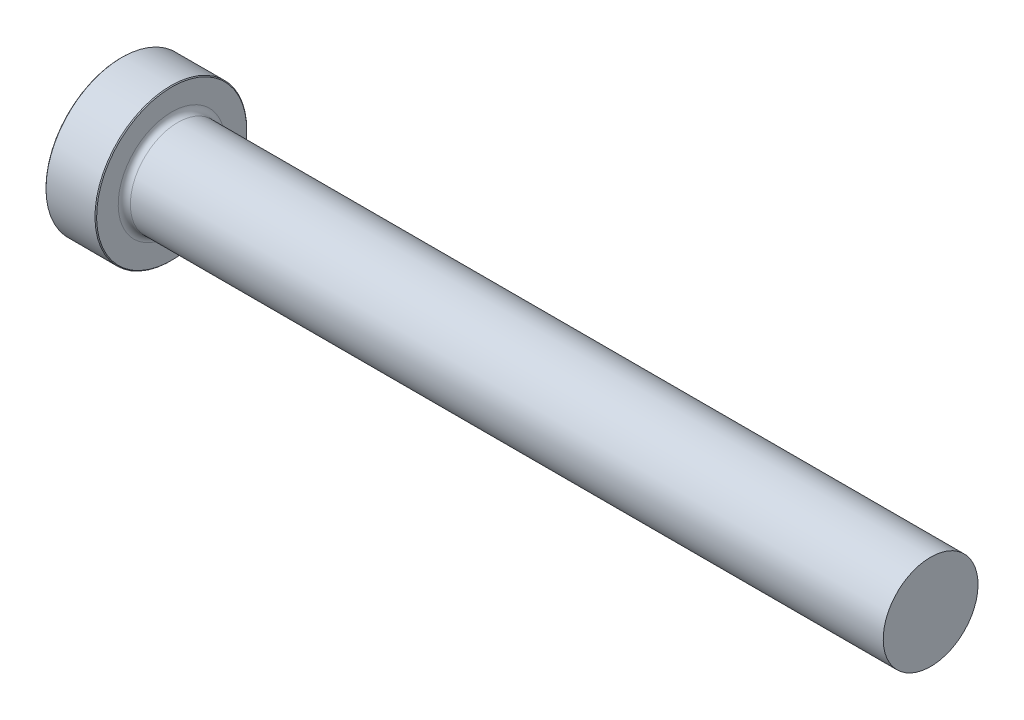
ISO-10303-21;
HEADER;
FILE_DESCRIPTION(('STEP AP214'),'2;1');
FILE_NAME('part.step','',(''),(''),'','','');
FILE_SCHEMA(('AUTOMOTIVE_DESIGN { 1 0 10303 214 1 1 1 1 }'));
ENDSEC;
DATA;
#1=APPLICATION_CONTEXT('core data for automotive mechanical design processes');
#2=APPLICATION_PROTOCOL_DEFINITION('international standard','automotive_design',2000,#1);
#3=PRODUCT_CONTEXT('',#1,'mechanical');
#4=PRODUCT('Part','Part','',(#3));
#5=PRODUCT_RELATED_PRODUCT_CATEGORY('part','',(#4));
#6=PRODUCT_DEFINITION_FORMATION('','',#4);
#7=PRODUCT_DEFINITION_CONTEXT('part definition',#1,'design');
#8=PRODUCT_DEFINITION('design','',#6,#7);
#9=PRODUCT_DEFINITION_SHAPE('','',#8);
#10=(LENGTH_UNIT() NAMED_UNIT(*) SI_UNIT(.MILLI.,.METRE.));
#11=(NAMED_UNIT(*) PLANE_ANGLE_UNIT() SI_UNIT($,.RADIAN.));
#12=(NAMED_UNIT(*) SI_UNIT($,.STERADIAN.) SOLID_ANGLE_UNIT());
#13=UNCERTAINTY_MEASURE_WITH_UNIT(LENGTH_MEASURE(1.E-05),#10,'distance_accuracy_value','');
#14=(GEOMETRIC_REPRESENTATION_CONTEXT(3) GLOBAL_UNCERTAINTY_ASSIGNED_CONTEXT((#13)) GLOBAL_UNIT_ASSIGNED_CONTEXT((#10,
#11,#12)) REPRESENTATION_CONTEXT('',''));
#15=CARTESIAN_POINT('',(0.,0.,0.));
#16=DIRECTION('',(0.,0.,1.));
#17=DIRECTION('',(1.,0.,0.));
#18=AXIS2_PLACEMENT_3D('',#15,#16,#17);
#19=CARTESIAN_POINT('',(101.6,5.94931499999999,0.));
#20=DIRECTION('',(1.,0.,0.));
#21=DIRECTION('',(0.,1.,0.));
#22=AXIS2_PLACEMENT_3D('',#19,#20,#21);
#23=PLANE('',#22);
#24=CARTESIAN_POINT('',(101.6,0.,0.));
#25=DIRECTION('',(1.,0.,0.));
#26=DIRECTION('',(0.,1.,0.));
#27=AXIS2_PLACEMENT_3D('',#24,#25,#26);
#28=CIRCLE('',#27,5.949315);
#29=CARTESIAN_POINT('',(101.6,5.94931499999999,0.));
#30=VERTEX_POINT('',#29);
#31=EDGE_CURVE('E50',#30,#30,#28,.T.);
#32=ORIENTED_EDGE('',*,*,#31,.T.);
#33=EDGE_LOOP('',(#32));
#34=FACE_BOUND('',#33,.T.);
#35=ADVANCED_FACE('F30',(#34),#23,.T.);
#36=CARTESIAN_POINT('',(101.6,0.,0.));
#37=DIRECTION('',(1.,0.,0.));
#38=DIRECTION('',(0.,1.,0.));
#39=AXIS2_PLACEMENT_3D('',#36,#37,#38);
#40=CYLINDRICAL_SURFACE('',#39,5.949315);
#41=CARTESIAN_POINT('',(7.11199999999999,0.,0.));
#42=DIRECTION('',(1.,0.,0.));
#43=DIRECTION('',(0.,1.,0.));
#44=AXIS2_PLACEMENT_3D('',#41,#42,#43);
#45=CIRCLE('',#44,5.94931499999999);
#46=CARTESIAN_POINT('',(7.11199999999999,5.94931499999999,0.));
#47=VERTEX_POINT('',#46);
#48=EDGE_CURVE('E53',#47,#47,#45,.T.);
#49=ORIENTED_EDGE('',*,*,#48,.T.);
#50=EDGE_LOOP('',(#49));
#51=FACE_BOUND('',#50,.T.);
#52=ORIENTED_EDGE('',*,*,#31,.F.);
#53=EDGE_LOOP('',(#52));
#54=FACE_BOUND('',#53,.T.);
#55=ADVANCED_FACE('F74',(#51,#54),#40,.T.);
#56=CARTESIAN_POINT('',(7.112,0.,0.));
#57=DIRECTION('',(1.,0.,0.));
#58=DIRECTION('',(0.,1.,0.));
#59=AXIS2_PLACEMENT_3D('',#56,#57,#58);
#60=TOROIDAL_SURFACE('',#59,6.71131499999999,0.762);
#61=CARTESIAN_POINT('',(6.34999999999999,0.,0.));
#62=DIRECTION('',(1.,0.,0.));
#63=DIRECTION('',(0.,1.,0.));
#64=AXIS2_PLACEMENT_3D('',#61,#62,#63);
#65=CIRCLE('',#64,6.71131499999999);
#66=CARTESIAN_POINT('',(6.34999999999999,6.71131499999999,0.));
#67=VERTEX_POINT('',#66);
#68=EDGE_CURVE('E56',#67,#67,#65,.T.);
#69=ORIENTED_EDGE('',*,*,#68,.T.);
#70=EDGE_LOOP('',(#69));
#71=FACE_BOUND('',#70,.T.);
#72=ORIENTED_EDGE('',*,*,#48,.F.);
#73=EDGE_LOOP('',(#72));
#74=FACE_BOUND('',#73,.T.);
#75=ADVANCED_FACE('F60',(#71,#74),#60,.F.);
#76=CARTESIAN_POINT('',(6.35,9.525,0.));
#77=DIRECTION('',(1.,0.,0.));
#78=DIRECTION('',(0.,1.,0.));
#79=AXIS2_PLACEMENT_3D('',#76,#77,#78);
#80=PLANE('',#79);
#81=CARTESIAN_POINT('',(6.35,0.,0.));
#82=DIRECTION('',(1.,0.,0.));
#83=DIRECTION('',(0.,1.,0.));
#84=AXIS2_PLACEMENT_3D('',#81,#82,#83);
#85=CIRCLE('',#84,9.42340000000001);
#86=CARTESIAN_POINT('',(6.35,9.42340000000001,0.));
#87=VERTEX_POINT('',#86);
#88=EDGE_CURVE('E10',#87,#87,#85,.T.);
#89=ORIENTED_EDGE('',*,*,#88,.T.);
#90=EDGE_LOOP('',(#89));
#91=FACE_BOUND('',#90,.T.);
#92=ORIENTED_EDGE('',*,*,#68,.F.);
#93=EDGE_LOOP('',(#92));
#94=FACE_BOUND('',#93,.T.);
#95=ADVANCED_FACE('F63',(#91,#94),#80,.T.);
#96=CARTESIAN_POINT('',(101.6,0.,0.));
#97=DIRECTION('',(1.,0.,0.));
#98=DIRECTION('',(0.,1.,0.));
#99=AXIS2_PLACEMENT_3D('',#96,#97,#98);
#100=CYLINDRICAL_SURFACE('',#99,9.525);
#101=CARTESIAN_POINT('',(0.101599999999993,0.,0.));
#102=DIRECTION('',(-1.,0.,0.));
#103=DIRECTION('',(0.,-1.,0.));
#104=AXIS2_PLACEMENT_3D('',#101,#102,#103);
#105=CIRCLE('',#104,9.525);
#106=CARTESIAN_POINT('',(0.101599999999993,-9.525,0.));
#107=VERTEX_POINT('',#106);
#108=EDGE_CURVE('E41',#107,#107,#105,.F.);
#109=ORIENTED_EDGE('',*,*,#108,.T.);
#110=EDGE_LOOP('',(#109));
#111=FACE_BOUND('',#110,.T.);
#112=CARTESIAN_POINT('',(6.24840000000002,0.,0.));
#113=DIRECTION('',(1.,0.,0.));
#114=DIRECTION('',(0.,1.,0.));
#115=AXIS2_PLACEMENT_3D('',#112,#113,#114);
#116=CIRCLE('',#115,9.525);
#117=CARTESIAN_POINT('',(6.24840000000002,9.525,0.));
#118=VERTEX_POINT('',#117);
#119=EDGE_CURVE('E45',#118,#118,#116,.F.);
#120=ORIENTED_EDGE('',*,*,#119,.T.);
#121=EDGE_LOOP('',(#120));
#122=FACE_BOUND('',#121,.T.);
#123=ADVANCED_FACE('F65',(#111,#122),#100,.T.);
#124=CARTESIAN_POINT('',(0.,0.,0.));
#125=DIRECTION('',(-1.,0.,0.));
#126=DIRECTION('',(0.,-1.,0.));
#127=AXIS2_PLACEMENT_3D('',#124,#125,#126);
#128=PLANE('',#127);
#129=CARTESIAN_POINT('',(0.,0.,0.));
#130=DIRECTION('',(-1.,0.,0.));
#131=DIRECTION('',(0.,-1.,0.));
#132=AXIS2_PLACEMENT_3D('',#129,#130,#131);
#133=CIRCLE('',#132,9.4234);
#134=CARTESIAN_POINT('',(0.,-9.4234,0.));
#135=VERTEX_POINT('',#134);
#136=EDGE_CURVE('E37',#135,#135,#133,.T.);
#137=ORIENTED_EDGE('',*,*,#136,.T.);
#138=EDGE_LOOP('',(#137));
#139=FACE_BOUND('',#138,.T.);
#140=ADVANCED_FACE('F71',(#139),#128,.T.);
#141=CARTESIAN_POINT('',(0.101599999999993,0.,0.));
#142=DIRECTION('',(1.,0.,0.));
#143=DIRECTION('',(0.,1.,0.));
#144=AXIS2_PLACEMENT_3D('',#141,#142,#143);
#145=CONICAL_SURFACE('',#144,9.525,0.785398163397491);
#146=ORIENTED_EDGE('',*,*,#136,.F.);
#147=EDGE_LOOP('',(#146));
#148=FACE_BOUND('',#147,.T.);
#149=ORIENTED_EDGE('',*,*,#108,.F.);
#150=EDGE_LOOP('',(#149));
#151=FACE_BOUND('',#150,.T.);
#152=ADVANCED_FACE('F84',(#148,#151),#145,.T.);
#153=CARTESIAN_POINT('',(6.34999999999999,0.,0.));
#154=DIRECTION('',(-1.,0.,0.));
#155=DIRECTION('',(0.,-1.,0.));
#156=AXIS2_PLACEMENT_3D('',#153,#154,#155);
#157=CONICAL_SURFACE('',#156,9.42340000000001,0.785398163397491);
#158=ORIENTED_EDGE('',*,*,#119,.F.);
#159=EDGE_LOOP('',(#158));
#160=FACE_BOUND('',#159,.T.);
#161=ORIENTED_EDGE('',*,*,#88,.F.);
#162=EDGE_LOOP('',(#161));
#163=FACE_BOUND('',#162,.T.);
#164=ADVANCED_FACE('F32',(#160,#163),#157,.T.);
#165=CLOSED_SHELL('',(#35,#55,#75,#95,#123,#140,#152,#164));
#166=MANIFOLD_SOLID_BREP('B2',#165);
#167=ADVANCED_BREP_SHAPE_REPRESENTATION('',(#18,#166),#14);
#168=SHAPE_DEFINITION_REPRESENTATION(#9,#167);
ENDSEC;
END-ISO-10303-21;
